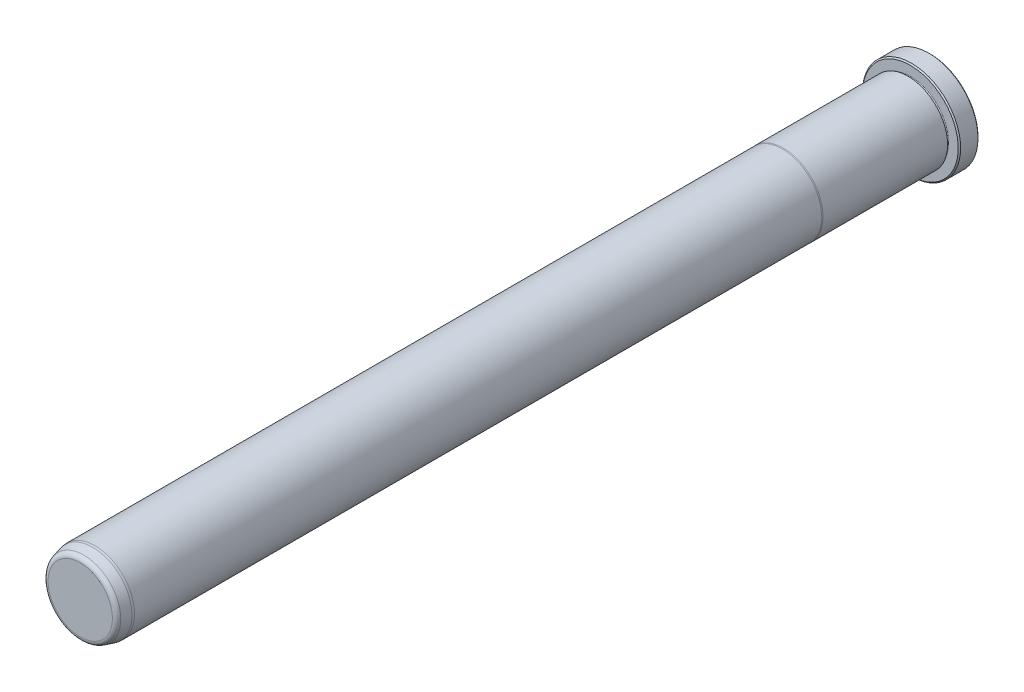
ISO-10303-21;
HEADER;
FILE_DESCRIPTION(('STEP AP214'),'2;1');
FILE_NAME('part.step','',(''),(''),'','','');
FILE_SCHEMA(('AUTOMOTIVE_DESIGN { 1 0 10303 214 1 1 1 1 }'));
ENDSEC;
DATA;
#1=APPLICATION_CONTEXT('core data for automotive mechanical design processes');
#2=APPLICATION_PROTOCOL_DEFINITION('international standard','automotive_design',2000,#1);
#3=PRODUCT_CONTEXT('',#1,'mechanical');
#4=PRODUCT('Part','Part','',(#3));
#5=PRODUCT_RELATED_PRODUCT_CATEGORY('part','',(#4));
#6=PRODUCT_DEFINITION_FORMATION('','',#4);
#7=PRODUCT_DEFINITION_CONTEXT('part definition',#1,'design');
#8=PRODUCT_DEFINITION('design','',#6,#7);
#9=PRODUCT_DEFINITION_SHAPE('','',#8);
#10=(LENGTH_UNIT() NAMED_UNIT(*) SI_UNIT(.MILLI.,.METRE.));
#11=(NAMED_UNIT(*) PLANE_ANGLE_UNIT() SI_UNIT($,.RADIAN.));
#12=(NAMED_UNIT(*) SI_UNIT($,.STERADIAN.) SOLID_ANGLE_UNIT());
#13=UNCERTAINTY_MEASURE_WITH_UNIT(LENGTH_MEASURE(1.E-05),#10,'distance_accuracy_value','');
#14=(GEOMETRIC_REPRESENTATION_CONTEXT(3) GLOBAL_UNCERTAINTY_ASSIGNED_CONTEXT((#13)) GLOBAL_UNIT_ASSIGNED_CONTEXT((#10,
#11,#12)) REPRESENTATION_CONTEXT('',''));
#15=CARTESIAN_POINT('',(0.,0.,0.));
#16=DIRECTION('',(0.,0.,1.));
#17=DIRECTION('',(1.,0.,0.));
#18=AXIS2_PLACEMENT_3D('',#15,#16,#17);
#19=CARTESIAN_POINT('',(0.,0.,0.));
#20=DIRECTION('',(0.,0.,1.));
#21=DIRECTION('',(1.,0.,0.));
#22=AXIS2_PLACEMENT_3D('',#19,#20,#21);
#23=PLANE('',#22);
#24=CARTESIAN_POINT('',(0.,0.,0.));
#25=DIRECTION('',(0.,0.,1.));
#26=DIRECTION('',(1.,0.,0.));
#27=AXIS2_PLACEMENT_3D('',#24,#25,#26);
#28=CIRCLE('',#27,15.367);
#29=CARTESIAN_POINT('',(15.367,0.,0.));
#30=VERTEX_POINT('',#29);
#31=EDGE_CURVE('E37',#30,#30,#28,.F.);
#32=ORIENTED_EDGE('',*,*,#31,.T.);
#33=EDGE_LOOP('',(#32));
#34=FACE_BOUND('',#33,.T.);
#35=ADVANCED_FACE('F30',(#34),#23,.F.);
#36=CARTESIAN_POINT('',(0.,0.,0.));
#37=DIRECTION('',(0.,0.,1.));
#38=DIRECTION('',(1.,0.,0.));
#39=AXIS2_PLACEMENT_3D('',#36,#37,#38);
#40=CYLINDRICAL_SURFACE('',#39,15.748);
#41=CARTESIAN_POINT('',(0.,0.,0.381000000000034));
#42=DIRECTION('',(0.,0.,1.));
#43=DIRECTION('',(1.,0.,0.));
#44=AXIS2_PLACEMENT_3D('',#41,#42,#43);
#45=CIRCLE('',#44,15.748);
#46=CARTESIAN_POINT('',(15.748,0.,0.381000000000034));
#47=VERTEX_POINT('',#46);
#48=EDGE_CURVE('E41',#47,#47,#45,.T.);
#49=ORIENTED_EDGE('',*,*,#48,.T.);
#50=EDGE_LOOP('',(#49));
#51=FACE_BOUND('',#50,.T.);
#52=CARTESIAN_POINT('',(0.,0.,5.96900000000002));
#53=DIRECTION('',(0.,0.,-1.));
#54=DIRECTION('',(-1.,0.,0.));
#55=AXIS2_PLACEMENT_3D('',#52,#53,#54);
#56=CIRCLE('',#55,15.748);
#57=CARTESIAN_POINT('',(-15.748,0.,5.96900000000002));
#58=VERTEX_POINT('',#57);
#59=EDGE_CURVE('E45',#58,#58,#56,.T.);
#60=ORIENTED_EDGE('',*,*,#59,.T.);
#61=EDGE_LOOP('',(#60));
#62=FACE_BOUND('',#61,.T.);
#63=ADVANCED_FACE('F118',(#51,#62),#40,.T.);
#64=CARTESIAN_POINT('',(0.,15.748,6.35));
#65=DIRECTION('',(0.,0.,-1.));
#66=DIRECTION('',(-1.,0.,0.));
#67=AXIS2_PLACEMENT_3D('',#64,#65,#66);
#68=PLANE('',#67);
#69=CARTESIAN_POINT('',(0.,0.,6.35));
#70=DIRECTION('',(0.,0.,-1.));
#71=DIRECTION('',(-1.,0.,0.));
#72=AXIS2_PLACEMENT_3D('',#69,#70,#71);
#73=CIRCLE('',#72,15.367);
#74=CARTESIAN_POINT('',(-15.367,0.,6.35));
#75=VERTEX_POINT('',#74);
#76=EDGE_CURVE('E10',#75,#75,#73,.F.);
#77=ORIENTED_EDGE('',*,*,#76,.T.);
#78=EDGE_LOOP('',(#77));
#79=FACE_BOUND('',#78,.T.);
#80=CARTESIAN_POINT('',(0.,0.,6.35));
#81=DIRECTION('',(0.,0.,1.));
#82=DIRECTION('',(1.,0.,0.));
#83=AXIS2_PLACEMENT_3D('',#80,#81,#82);
#84=CIRCLE('',#83,12.3063);
#85=CARTESIAN_POINT('',(12.3063,0.,6.35));
#86=VERTEX_POINT('',#85);
#87=EDGE_CURVE('E56',#86,#86,#84,.T.);
#88=ORIENTED_EDGE('',*,*,#87,.F.);
#89=EDGE_LOOP('',(#88));
#90=FACE_BOUND('',#89,.T.);
#91=ADVANCED_FACE('F113',(#79,#90),#68,.F.);
#92=CARTESIAN_POINT('',(0.,0.,6.731));
#93=DIRECTION('',(0.,0.,1.));
#94=DIRECTION('',(1.,0.,0.));
#95=AXIS2_PLACEMENT_3D('',#92,#93,#94);
#96=TOROIDAL_SURFACE('',#95,12.3063,0.381);
#97=CARTESIAN_POINT('',(0.,0.,7.112));
#98=DIRECTION('',(0.,0.,1.));
#99=DIRECTION('',(1.,0.,0.));
#100=AXIS2_PLACEMENT_3D('',#97,#98,#99);
#101=CIRCLE('',#100,12.3063);
#102=CARTESIAN_POINT('',(12.3063,0.,7.112));
#103=VERTEX_POINT('',#102);
#104=EDGE_CURVE('E59',#103,#103,#101,.T.);
#105=ORIENTED_EDGE('',*,*,#104,.F.);
#106=EDGE_LOOP('',(#105));
#107=FACE_BOUND('',#106,.T.);
#108=ORIENTED_EDGE('',*,*,#87,.T.);
#109=EDGE_LOOP('',(#108));
#110=FACE_BOUND('',#109,.T.);
#111=ADVANCED_FACE('F107',(#107,#110),#96,.F.);
#112=CARTESIAN_POINT('',(0.,12.3063,7.112));
#113=DIRECTION('',(0.,0.,1.));
#114=DIRECTION('',(1.,0.,0.));
#115=AXIS2_PLACEMENT_3D('',#112,#113,#114);
#116=PLANE('',#115);
#117=CARTESIAN_POINT('',(0.,0.,7.112));
#118=DIRECTION('',(0.,0.,1.));
#119=DIRECTION('',(1.,0.,0.));
#120=AXIS2_PLACEMENT_3D('',#117,#118,#119);
#121=CIRCLE('',#120,12.7127);
#122=CARTESIAN_POINT('',(12.7127,0.,7.112));
#123=VERTEX_POINT('',#122);
#124=EDGE_CURVE('E62',#123,#123,#121,.T.);
#125=ORIENTED_EDGE('',*,*,#124,.F.);
#126=EDGE_LOOP('',(#125));
#127=FACE_BOUND('',#126,.T.);
#128=ORIENTED_EDGE('',*,*,#104,.T.);
#129=EDGE_LOOP('',(#128));
#130=FACE_BOUND('',#129,.T.);
#131=ADVANCED_FACE('F101',(#127,#130),#116,.F.);
#132=CARTESIAN_POINT('',(0.,0.,0.));
#133=DIRECTION('',(0.,0.,1.));
#134=DIRECTION('',(1.,0.,0.));
#135=AXIS2_PLACEMENT_3D('',#132,#133,#134);
#136=CYLINDRICAL_SURFACE('',#135,12.7127);
#137=CARTESIAN_POINT('',(0.,0.,47.1347630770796));
#138=DIRECTION('',(0.,0.,1.));
#139=DIRECTION('',(1.,0.,0.));
#140=AXIS2_PLACEMENT_3D('',#137,#138,#139);
#141=CIRCLE('',#140,12.7127);
#142=CARTESIAN_POINT('',(12.7127,0.,47.1347630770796));
#143=VERTEX_POINT('',#142);
#144=EDGE_CURVE('E65',#143,#143,#141,.T.);
#145=ORIENTED_EDGE('',*,*,#144,.F.);
#146=EDGE_LOOP('',(#145));
#147=FACE_BOUND('',#146,.T.);
#148=ORIENTED_EDGE('',*,*,#124,.T.);
#149=EDGE_LOOP('',(#148));
#150=FACE_BOUND('',#149,.T.);
#151=ADVANCED_FACE('F95',(#147,#150),#136,.T.);
#152=CARTESIAN_POINT('',(0.,0.,47.1347630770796));
#153=DIRECTION('',(0.,0.,-1.));
#154=DIRECTION('',(-1.,0.,0.));
#155=AXIS2_PLACEMENT_3D('',#152,#153,#154);
#156=CONICAL_SURFACE('',#155,12.7127,0.0698131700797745);
#157=CARTESIAN_POINT('',(0.,0.,47.498));
#158=DIRECTION('',(0.,0.,1.));
#159=DIRECTION('',(1.,0.,0.));
#160=AXIS2_PLACEMENT_3D('',#157,#158,#159);
#161=CIRCLE('',#160,12.6873);
#162=CARTESIAN_POINT('',(12.6873,0.,47.498));
#163=VERTEX_POINT('',#162);
#164=EDGE_CURVE('E68',#163,#163,#161,.T.);
#165=ORIENTED_EDGE('',*,*,#164,.F.);
#166=EDGE_LOOP('',(#165));
#167=FACE_BOUND('',#166,.T.);
#168=ORIENTED_EDGE('',*,*,#144,.T.);
#169=EDGE_LOOP('',(#168));
#170=FACE_BOUND('',#169,.T.);
#171=ADVANCED_FACE('F89',(#167,#170),#156,.T.);
#172=CARTESIAN_POINT('',(0.,0.,0.));
#173=DIRECTION('',(0.,0.,1.));
#174=DIRECTION('',(1.,0.,0.));
#175=AXIS2_PLACEMENT_3D('',#172,#173,#174);
#176=CYLINDRICAL_SURFACE('',#175,12.6873);
#177=CARTESIAN_POINT('',(0.,0.,268.2875));
#178=DIRECTION('',(0.,0.,1.));
#179=DIRECTION('',(1.,0.,0.));
#180=AXIS2_PLACEMENT_3D('',#177,#178,#179);
#181=CIRCLE('',#180,12.6873);
#182=CARTESIAN_POINT('',(12.6873,0.,268.2875));
#183=VERTEX_POINT('',#182);
#184=EDGE_CURVE('E71',#183,#183,#181,.T.);
#185=ORIENTED_EDGE('',*,*,#184,.F.);
#186=EDGE_LOOP('',(#185));
#187=FACE_BOUND('',#186,.T.);
#188=ORIENTED_EDGE('',*,*,#164,.T.);
#189=EDGE_LOOP('',(#188));
#190=FACE_BOUND('',#189,.T.);
#191=ADVANCED_FACE('F83',(#187,#190),#176,.T.);
#192=CARTESIAN_POINT('',(0.,0.,268.2875));
#193=DIRECTION('',(0.,0.,-1.));
#194=DIRECTION('',(-1.,0.,0.));
#195=AXIS2_PLACEMENT_3D('',#192,#193,#194);
#196=CONICAL_SURFACE('',#195,12.6873,0.087266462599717);
#197=CARTESIAN_POINT('',(0.,0.,269.0495));
#198=DIRECTION('',(0.,0.,1.));
#199=DIRECTION('',(1.,0.,0.));
#200=AXIS2_PLACEMENT_3D('',#197,#198,#199);
#201=CIRCLE('',#200,12.6206336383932);
#202=CARTESIAN_POINT('',(12.6206336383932,0.,269.0495));
#203=VERTEX_POINT('',#202);
#204=EDGE_CURVE('E74',#203,#203,#201,.T.);
#205=ORIENTED_EDGE('',*,*,#204,.F.);
#206=EDGE_LOOP('',(#205));
#207=FACE_BOUND('',#206,.T.);
#208=ORIENTED_EDGE('',*,*,#184,.T.);
#209=EDGE_LOOP('',(#208));
#210=FACE_BOUND('',#209,.T.);
#211=ADVANCED_FACE('F80',(#207,#210),#196,.T.);
#212=CARTESIAN_POINT('',(0.,0.,269.0495));
#213=DIRECTION('',(0.,0.,-1.));
#214=DIRECTION('',(-1.,0.,0.));
#215=AXIS2_PLACEMENT_3D('',#212,#213,#214);
#216=CONICAL_SURFACE('',#215,12.6206336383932,0.26179938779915);
#217=CARTESIAN_POINT('',(0.,0.,271.8733752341));
#218=DIRECTION('',(0.,0.,1.));
#219=DIRECTION('',(1.,0.,0.));
#220=AXIS2_PLACEMENT_3D('',#217,#218,#219);
#221=CIRCLE('',#220,11.8639785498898);
#222=CARTESIAN_POINT('',(11.8639785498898,0.,271.8733752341));
#223=VERTEX_POINT('',#222);
#224=EDGE_CURVE('E50',#223,#223,#221,.F.);
#225=ORIENTED_EDGE('',*,*,#224,.T.);
#226=EDGE_LOOP('',(#225));
#227=FACE_BOUND('',#226,.T.);
#228=ORIENTED_EDGE('',*,*,#204,.T.);
#229=EDGE_LOOP('',(#228));
#230=FACE_BOUND('',#229,.T.);
#231=ADVANCED_FACE('F78',(#227,#230),#216,.T.);
#232=CARTESIAN_POINT('',(0.,11.5487028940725,273.05));
#233=DIRECTION('',(0.,0.,-1.));
#234=DIRECTION('',(-1.,0.,0.));
#235=AXIS2_PLACEMENT_3D('',#232,#233,#234);
#236=PLANE('',#235);
#237=CARTESIAN_POINT('',(0.,0.,273.05));
#238=DIRECTION('',(0.,0.,-1.));
#239=DIRECTION('',(-1.,0.,0.));
#240=AXIS2_PLACEMENT_3D('',#237,#238,#239);
#241=CIRCLE('',#240,10.3305713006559);
#242=CARTESIAN_POINT('',(-10.3305713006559,0.,273.05));
#243=VERTEX_POINT('',#242);
#244=EDGE_CURVE('E53',#243,#243,#241,.F.);
#245=ORIENTED_EDGE('',*,*,#244,.T.);
#246=EDGE_LOOP('',(#245));
#247=FACE_BOUND('',#246,.T.);
#248=ADVANCED_FACE('F133',(#247),#236,.F.);
#249=CARTESIAN_POINT('',(0.,0.,271.4625));
#250=DIRECTION('',(0.,0.,-1.));
#251=DIRECTION('',(-1.,0.,0.));
#252=AXIS2_PLACEMENT_3D('',#249,#250,#251);
#253=TOROIDAL_SURFACE('',#252,10.3305713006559,1.5875);
#254=ORIENTED_EDGE('',*,*,#224,.F.);
#255=EDGE_LOOP('',(#254));
#256=FACE_BOUND('',#255,.T.);
#257=ORIENTED_EDGE('',*,*,#244,.F.);
#258=EDGE_LOOP('',(#257));
#259=FACE_BOUND('',#258,.T.);
#260=ADVANCED_FACE('F130',(#256,#259),#253,.T.);
#261=CARTESIAN_POINT('',(0.,0.,0.381000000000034));
#262=DIRECTION('',(0.,0.,1.));
#263=DIRECTION('',(1.,0.,0.));
#264=AXIS2_PLACEMENT_3D('',#261,#262,#263);
#265=CONICAL_SURFACE('',#264,15.748,0.785398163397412);
#266=ORIENTED_EDGE('',*,*,#31,.F.);
#267=EDGE_LOOP('',(#266));
#268=FACE_BOUND('',#267,.T.);
#269=ORIENTED_EDGE('',*,*,#48,.F.);
#270=EDGE_LOOP('',(#269));
#271=FACE_BOUND('',#270,.T.);
#272=ADVANCED_FACE('F132',(#268,#271),#265,.T.);
#273=CARTESIAN_POINT('',(0.,0.,6.35));
#274=DIRECTION('',(0.,0.,-1.));
#275=DIRECTION('',(-1.,0.,0.));
#276=AXIS2_PLACEMENT_3D('',#273,#274,#275);
#277=CONICAL_SURFACE('',#276,15.367,0.785398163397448);
#278=ORIENTED_EDGE('',*,*,#59,.F.);
#279=EDGE_LOOP('',(#278));
#280=FACE_BOUND('',#279,.T.);
#281=ORIENTED_EDGE('',*,*,#76,.F.);
#282=EDGE_LOOP('',(#281));
#283=FACE_BOUND('',#282,.T.);
#284=ADVANCED_FACE('F32',(#280,#283),#277,.T.);
#285=CLOSED_SHELL('',(#35,#63,#91,#111,#131,#151,#171,#191,#211,#231,#248,#260,#272,#284));
#286=MANIFOLD_SOLID_BREP('B2',#285);
#287=ADVANCED_BREP_SHAPE_REPRESENTATION('',(#18,#286),#14);
#288=SHAPE_DEFINITION_REPRESENTATION(#9,#287);
ENDSEC;
END-ISO-10303-21;
